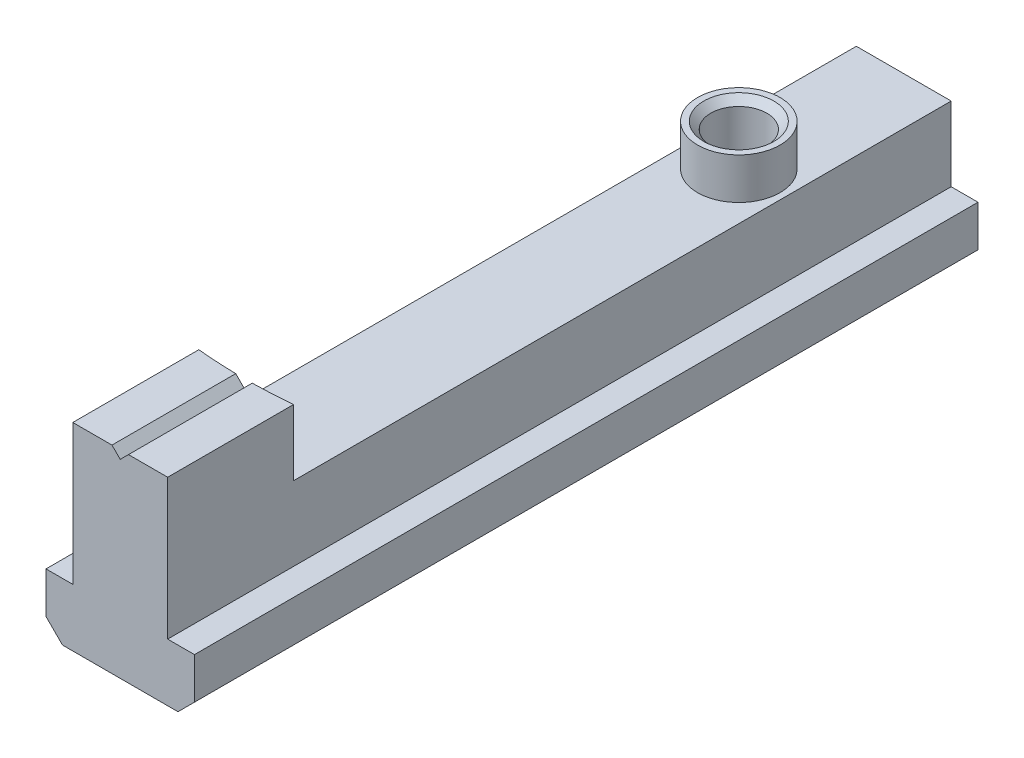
from build123d import *

# Parameters (mm, degrees)
AUFSATZ_LINEAR_AUSTRAGEN1_DEPTH = 95
FASE1_SIZE                      = 2
SCHNITT_LINEAR_AUSTRAGEN1_DEPTH = 20
SKIZZE6_R                       = 60
SKIZZE6_R_2                     = 5
SCHNITT_LINEAR_AUSTRAGEN2_DEPTH = 8
SKIZZE9_R                       = 5
SCHNITT_LINEAR_AUSTRAGEN3_DEPTH = 3


with BuildPart() as part:
    # Skizze1 → Aufsatz-Linear austragen1 (new body)
    with BuildSketch(Plane.XY):
        Polygon((0, 0), (18, 0), (18, 7), (14.75, 7), (14.75, 24), (3.25, 24), (3.25, 7), (0, 7), align=None)
    extrude(amount=AUFSATZ_LINEAR_AUSTRAGEN1_DEPTH)

    # Fase1
    fase1_edges = [part.edges().sort_by_distance(p)[0] for p in [
        (18, 0, 47.5),
        (0, 0, 47.5),
    ]]
    chamfer(fase1_edges, length=FASE1_SIZE)

    # Skizze4 → Schnitt-Linear austragen1 (cut)
    with BuildSketch(Plane.XY.offset(95)):
        Polygon((9, 23), (8, 24), (10, 24), align=None)
    extrude(amount=-SCHNITT_LINEAR_AUSTRAGEN1_DEPTH, mode=Mode.SUBTRACT)

    # Skizze6 → Schnitt-Linear austragen2 (cut)
    with BuildSketch(Plane(origin=(0, 24, 0), x_dir=(1, 0, 0), z_dir=(0, 1, 0))):
        with Locations((9, -20)):
            Circle(SKIZZE6_R)
        with Locations(Location((9, -20, 0), (0, 0, 270))):
            Circle(SKIZZE6_R_2, mode=Mode.SUBTRACT)
    extrude(amount=-SCHNITT_LINEAR_AUSTRAGEN2_DEPTH, mode=Mode.SUBTRACT)

    # Skizze9 → Schnitt-Linear austragen3 (cut)
    with BuildSketch(Plane(origin=(0, 24, 0), x_dir=(1, 0, 0), z_dir=(0, 1, 0))):
        with Locations(Location((9, -20, 0), (0, 0, 270))):
            Circle(SKIZZE9_R)
    extrude(amount=-SCHNITT_LINEAR_AUSTRAGEN3_DEPTH, mode=Mode.SUBTRACT)

    # Skizze10 → M8 Gewindebohrung2 (revolve, cut)
    with BuildSketch(Plane(origin=(9, 21, 20), x_dir=(0, 0, 1), z_dir=(1, 0, 0))):
        Polygon((0, 0), (0, 21), (4.25, 21), (3.4, 20.15), (3.4, 0.85), (4.25, 0), align=None)
    revolve(axis=Axis((9, 27.35, 20), (0, -1, 0)), mode=Mode.SUBTRACT)


solid = part.part
